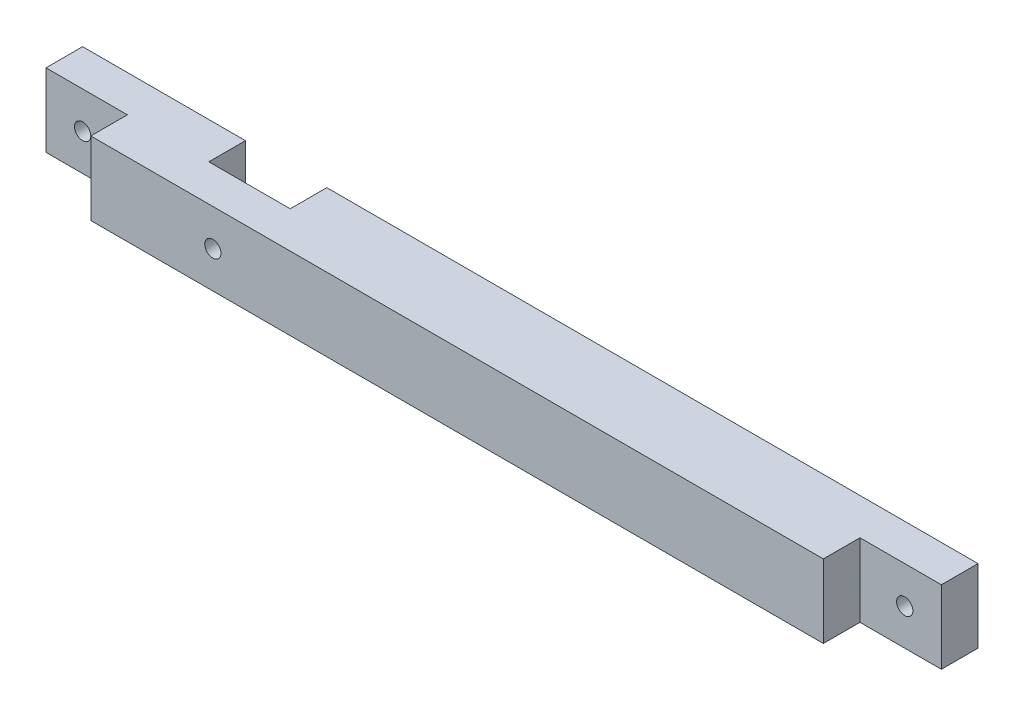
from build123d import *

# Parameters (mm, degrees)
ESQUISSE1_W             = 110
ESQUISSE1_H             = 9
EXTRUSION1_DEPTH        = 9
ESQUISSE2_W             = 10
ESQUISSE2_H             = 9
ENL_V_MAT_EXTRU_1_DEPTH = 4.5
ESQUISSE4_R             = 1
ENL_V_MAT_EXTRU_2_DEPTH = 4.5
ESQUISSE5_R             = 1
ENL_V_MAT_EXTRU_3_DEPTH = 4.5
ESQUISSE6_W             = 10
ESQUISSE6_H             = 9
ENL_V_MAT_EXTRU_4_DEPTH = 4.5
ESQUISSE7_R             = 1
ENL_V_MAT_EXTRU_5_DEPTH = 4.5


with BuildPart() as part:
    # Esquisse1 → Extrusion1 (new body)
    with BuildSketch(Plane.XY):
        with Locations((-12.271684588, -105.117562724)):
            Rectangle(ESQUISSE1_W, ESQUISSE1_H)
    extrude(amount=EXTRUSION1_DEPTH)

    # Esquisse2 → Enl_v. mat.-Extru.1 (cut)
    with BuildSketch(Plane.XY.offset(9)):
        with Locations((-62.271684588, -105.117562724)):
            Rectangle(ESQUISSE2_W, ESQUISSE2_H)
        with Locations((37.728315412, -105.117562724)):
            Rectangle(ESQUISSE2_W, ESQUISSE2_H)
    extrude(amount=-ENL_V_MAT_EXTRU_1_DEPTH, mode=Mode.SUBTRACT)

    # Esquisse4 → Enl_v. mat.-Extru.2 (cut)
    with BuildSketch(Plane.XY.offset(4.5)):
        with Locations((38.22840174, -105.145436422)):
            Circle(ESQUISSE4_R)
    extrude(amount=-ENL_V_MAT_EXTRU_2_DEPTH, mode=Mode.SUBTRACT)

    # Esquisse5 → Enl_v. mat.-Extru.3 (cut)
    with BuildSketch(Plane.XY.offset(4.5)):
        with Locations((-62.771684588, -105.117562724)):
            Circle(ESQUISSE5_R)
    extrude(amount=-ENL_V_MAT_EXTRU_3_DEPTH, mode=Mode.SUBTRACT)

    # Esquisse6 → Enl_v. mat.-Extru.4 (cut)
    with BuildSketch(Plane(origin=(0, 0, 0), x_dir=(-1, 0, 0), z_dir=(0, 0, -1))):
        with Locations((42.271684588, -105.117562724)):
            Rectangle(ESQUISSE6_W, ESQUISSE6_H)
    extrude(amount=-ENL_V_MAT_EXTRU_4_DEPTH, mode=Mode.SUBTRACT)

    # Esquisse7 → Enl_v. mat.-Extru.5 (cut)
    with BuildSketch(Plane(origin=(0, 0, 4.5), x_dir=(-1, 0, 0), z_dir=(0, 0, -1))):
        with Locations((42.271684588, -105.117562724)):
            Circle(ESQUISSE7_R)
    extrude(amount=-ENL_V_MAT_EXTRU_5_DEPTH, mode=Mode.SUBTRACT)


solid = part.part
